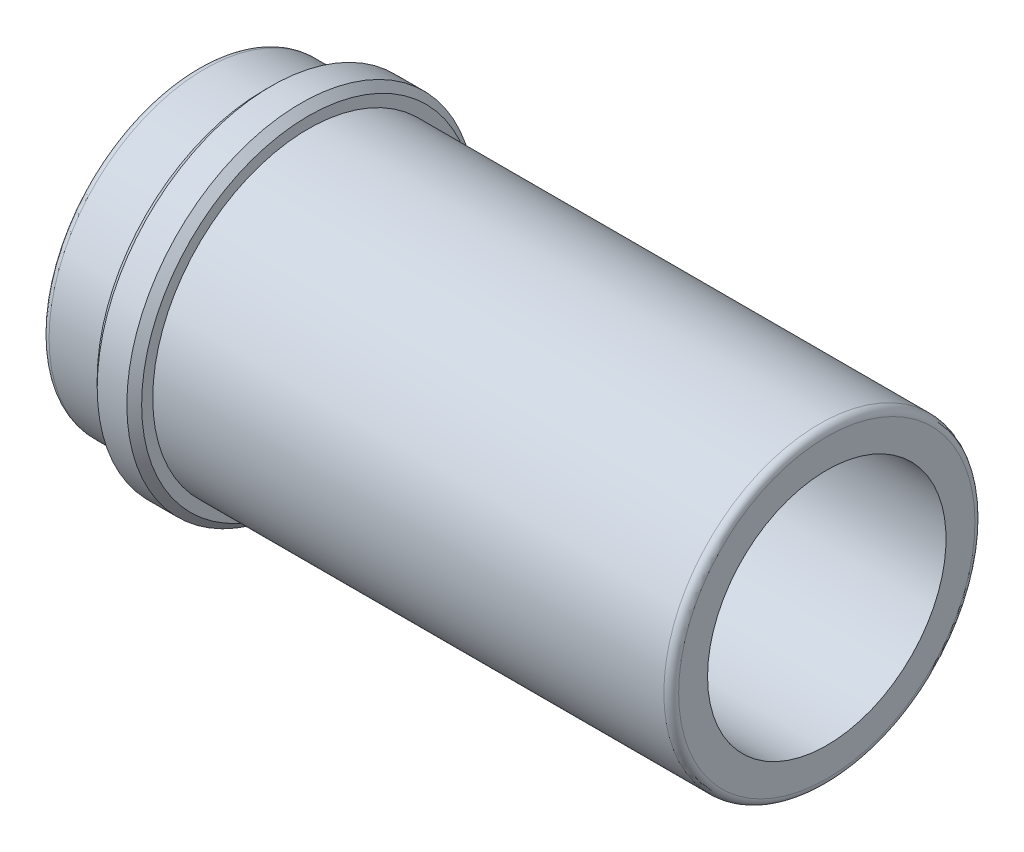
ISO-10303-21;
HEADER;
FILE_DESCRIPTION(('STEP AP214'),'2;1');
FILE_NAME('part.step','',(''),(''),'','','');
FILE_SCHEMA(('AUTOMOTIVE_DESIGN { 1 0 10303 214 1 1 1 1 }'));
ENDSEC;
DATA;
#1=APPLICATION_CONTEXT('core data for automotive mechanical design processes');
#2=APPLICATION_PROTOCOL_DEFINITION('international standard','automotive_design',2000,#1);
#3=PRODUCT_CONTEXT('',#1,'mechanical');
#4=PRODUCT('Part','Part','',(#3));
#5=PRODUCT_RELATED_PRODUCT_CATEGORY('part','',(#4));
#6=PRODUCT_DEFINITION_FORMATION('','',#4);
#7=PRODUCT_DEFINITION_CONTEXT('part definition',#1,'design');
#8=PRODUCT_DEFINITION('design','',#6,#7);
#9=PRODUCT_DEFINITION_SHAPE('','',#8);
#10=(LENGTH_UNIT() NAMED_UNIT(*) SI_UNIT(.MILLI.,.METRE.));
#11=(NAMED_UNIT(*) PLANE_ANGLE_UNIT() SI_UNIT($,.RADIAN.));
#12=(NAMED_UNIT(*) SI_UNIT($,.STERADIAN.) SOLID_ANGLE_UNIT());
#13=UNCERTAINTY_MEASURE_WITH_UNIT(LENGTH_MEASURE(1.E-05),#10,'distance_accuracy_value','');
#14=(GEOMETRIC_REPRESENTATION_CONTEXT(3) GLOBAL_UNCERTAINTY_ASSIGNED_CONTEXT((#13)) GLOBAL_UNIT_ASSIGNED_CONTEXT((#10,
#11,#12)) REPRESENTATION_CONTEXT('',''));
#15=CARTESIAN_POINT('',(0.,0.,0.));
#16=DIRECTION('',(0.,0.,1.));
#17=DIRECTION('',(1.,0.,0.));
#18=AXIS2_PLACEMENT_3D('',#15,#16,#17);
#19=CARTESIAN_POINT('',(9.,21.,0.));
#20=DIRECTION('',(1.,0.,0.));
#21=DIRECTION('',(0.,0.,-1.));
#22=AXIS2_PLACEMENT_3D('',#19,#20,#21);
#23=PLANE('',#22);
#24=CARTESIAN_POINT('',(9.,0.,0.));
#25=DIRECTION('',(1.,0.,0.));
#26=DIRECTION('',(0.,0.,-1.));
#27=AXIS2_PLACEMENT_3D('',#24,#25,#26);
#28=CIRCLE('',#27,22.5);
#29=CARTESIAN_POINT('',(9.,0.,-22.5));
#30=VERTEX_POINT('',#29);
#31=EDGE_CURVE('E9',#30,#30,#28,.F.);
#32=ORIENTED_EDGE('',*,*,#31,.T.);
#33=EDGE_LOOP('',(#32));
#34=FACE_BOUND('',#33,.T.);
#35=CARTESIAN_POINT('',(9.,0.,0.));
#36=DIRECTION('',(-1.,0.,0.));
#37=DIRECTION('',(0.,0.,1.));
#38=AXIS2_PLACEMENT_3D('',#35,#36,#37);
#39=CIRCLE('',#38,21.);
#40=CARTESIAN_POINT('',(9.,0.,21.));
#41=VERTEX_POINT('',#40);
#42=EDGE_CURVE('E55',#41,#41,#39,.T.);
#43=ORIENTED_EDGE('',*,*,#42,.F.);
#44=EDGE_LOOP('',(#43));
#45=FACE_BOUND('',#44,.T.);
#46=ADVANCED_FACE('F14',(#34,#45),#23,.F.);
#47=CARTESIAN_POINT('',(0.,0.,0.));
#48=DIRECTION('',(-1.,0.,0.));
#49=DIRECTION('',(0.,0.,1.));
#50=AXIS2_PLACEMENT_3D('',#47,#48,#49);
#51=CYLINDRICAL_SURFACE('',#50,23.5);
#52=CARTESIAN_POINT('',(14.,0.,0.));
#53=DIRECTION('',(-1.,0.,0.));
#54=DIRECTION('',(0.,0.,1.));
#55=AXIS2_PLACEMENT_3D('',#52,#53,#54);
#56=CIRCLE('',#55,23.5);
#57=CARTESIAN_POINT('',(14.,0.,23.5));
#58=VERTEX_POINT('',#57);
#59=EDGE_CURVE('E25',#58,#58,#56,.T.);
#60=ORIENTED_EDGE('',*,*,#59,.T.);
#61=EDGE_LOOP('',(#60));
#62=FACE_BOUND('',#61,.T.);
#63=CARTESIAN_POINT('',(10.,0.,0.));
#64=DIRECTION('',(1.,0.,0.));
#65=DIRECTION('',(0.,0.,-1.));
#66=AXIS2_PLACEMENT_3D('',#63,#64,#65);
#67=CIRCLE('',#66,23.5);
#68=CARTESIAN_POINT('',(10.,0.,-23.5));
#69=VERTEX_POINT('',#68);
#70=EDGE_CURVE('E29',#69,#69,#67,.T.);
#71=ORIENTED_EDGE('',*,*,#70,.T.);
#72=EDGE_LOOP('',(#71));
#73=FACE_BOUND('',#72,.T.);
#74=ADVANCED_FACE('F62',(#62,#73),#51,.T.);
#75=CARTESIAN_POINT('',(15.,23.5,0.));
#76=DIRECTION('',(-1.,0.,0.));
#77=DIRECTION('',(0.,0.,1.));
#78=AXIS2_PLACEMENT_3D('',#75,#76,#77);
#79=PLANE('',#78);
#80=CARTESIAN_POINT('',(15.,0.,0.));
#81=DIRECTION('',(-1.,0.,0.));
#82=DIRECTION('',(0.,0.,1.));
#83=AXIS2_PLACEMENT_3D('',#80,#81,#82);
#84=CIRCLE('',#83,22.5);
#85=CARTESIAN_POINT('',(15.,0.,22.5));
#86=VERTEX_POINT('',#85);
#87=EDGE_CURVE('E21',#86,#86,#84,.F.);
#88=ORIENTED_EDGE('',*,*,#87,.T.);
#89=EDGE_LOOP('',(#88));
#90=FACE_BOUND('',#89,.T.);
#91=CARTESIAN_POINT('',(15.,0.,0.));
#92=DIRECTION('',(-1.,0.,0.));
#93=DIRECTION('',(0.,0.,1.));
#94=AXIS2_PLACEMENT_3D('',#91,#92,#93);
#95=CIRCLE('',#94,21.);
#96=CARTESIAN_POINT('',(15.,0.,21.));
#97=VERTEX_POINT('',#96);
#98=EDGE_CURVE('E46',#97,#97,#95,.T.);
#99=ORIENTED_EDGE('',*,*,#98,.T.);
#100=EDGE_LOOP('',(#99));
#101=FACE_BOUND('',#100,.T.);
#102=ADVANCED_FACE('F69',(#90,#101),#79,.F.);
#103=CARTESIAN_POINT('',(0.,0.,0.));
#104=DIRECTION('',(-1.,0.,0.));
#105=DIRECTION('',(0.,0.,1.));
#106=AXIS2_PLACEMENT_3D('',#103,#104,#105);
#107=CYLINDRICAL_SURFACE('',#106,21.);
#108=CARTESIAN_POINT('',(84.,0.,0.));
#109=DIRECTION('',(-1.,0.,0.));
#110=DIRECTION('',(0.,0.,1.));
#111=AXIS2_PLACEMENT_3D('',#108,#109,#110);
#112=CIRCLE('',#111,21.);
#113=CARTESIAN_POINT('',(84.,0.,21.));
#114=VERTEX_POINT('',#113);
#115=EDGE_CURVE('E43',#114,#114,#112,.T.);
#116=ORIENTED_EDGE('',*,*,#115,.T.);
#117=EDGE_LOOP('',(#116));
#118=FACE_BOUND('',#117,.T.);
#119=ORIENTED_EDGE('',*,*,#98,.F.);
#120=EDGE_LOOP('',(#119));
#121=FACE_BOUND('',#120,.T.);
#122=ADVANCED_FACE('F114',(#118,#121),#107,.T.);
#123=CARTESIAN_POINT('',(85.,21.,0.));
#124=DIRECTION('',(-1.,0.,0.));
#125=DIRECTION('',(0.,0.,1.));
#126=AXIS2_PLACEMENT_3D('',#123,#124,#125);
#127=PLANE('',#126);
#128=CARTESIAN_POINT('',(85.,0.,0.));
#129=DIRECTION('',(-1.,0.,0.));
#130=DIRECTION('',(0.,0.,1.));
#131=AXIS2_PLACEMENT_3D('',#128,#129,#130);
#132=CIRCLE('',#131,20.);
#133=CARTESIAN_POINT('',(85.,0.,20.));
#134=VERTEX_POINT('',#133);
#135=EDGE_CURVE('E40',#134,#134,#132,.F.);
#136=ORIENTED_EDGE('',*,*,#135,.T.);
#137=EDGE_LOOP('',(#136));
#138=FACE_BOUND('',#137,.T.);
#139=CARTESIAN_POINT('',(85.,0.,0.));
#140=DIRECTION('',(-1.,0.,0.));
#141=DIRECTION('',(0.,0.,1.));
#142=AXIS2_PLACEMENT_3D('',#139,#140,#141);
#143=CIRCLE('',#142,16.1);
#144=CARTESIAN_POINT('',(85.,0.,16.1));
#145=VERTEX_POINT('',#144);
#146=EDGE_CURVE('E49',#145,#145,#143,.T.);
#147=ORIENTED_EDGE('',*,*,#146,.T.);
#148=EDGE_LOOP('',(#147));
#149=FACE_BOUND('',#148,.T.);
#150=ADVANCED_FACE('F144',(#138,#149),#127,.F.);
#151=CARTESIAN_POINT('',(0.,0.,0.));
#152=DIRECTION('',(-1.,0.,0.));
#153=DIRECTION('',(0.,0.,1.));
#154=AXIS2_PLACEMENT_3D('',#151,#152,#153);
#155=CYLINDRICAL_SURFACE('',#154,16.1);
#156=ORIENTED_EDGE('',*,*,#146,.F.);
#157=EDGE_LOOP('',(#156));
#158=FACE_BOUND('',#157,.T.);
#159=CARTESIAN_POINT('',(0.,0.,0.));
#160=DIRECTION('',(-1.,0.,0.));
#161=DIRECTION('',(0.,0.,1.));
#162=AXIS2_PLACEMENT_3D('',#159,#160,#161);
#163=CIRCLE('',#162,16.1);
#164=CARTESIAN_POINT('',(0.,0.,16.1));
#165=VERTEX_POINT('',#164);
#166=EDGE_CURVE('E52',#165,#165,#163,.T.);
#167=ORIENTED_EDGE('',*,*,#166,.T.);
#168=EDGE_LOOP('',(#167));
#169=FACE_BOUND('',#168,.T.);
#170=ADVANCED_FACE('F136',(#158,#169),#155,.F.);
#171=CARTESIAN_POINT('',(0.,16.1,0.));
#172=DIRECTION('',(1.,0.,0.));
#173=DIRECTION('',(0.,0.,-1.));
#174=AXIS2_PLACEMENT_3D('',#171,#172,#173);
#175=PLANE('',#174);
#176=CARTESIAN_POINT('',(0.,0.,0.));
#177=DIRECTION('',(1.,0.,0.));
#178=DIRECTION('',(0.,0.,-1.));
#179=AXIS2_PLACEMENT_3D('',#176,#177,#178);
#180=CIRCLE('',#179,20.);
#181=CARTESIAN_POINT('',(0.,0.,-20.));
#182=VERTEX_POINT('',#181);
#183=EDGE_CURVE('E37',#182,#182,#180,.F.);
#184=ORIENTED_EDGE('',*,*,#183,.T.);
#185=EDGE_LOOP('',(#184));
#186=FACE_BOUND('',#185,.T.);
#187=ORIENTED_EDGE('',*,*,#166,.F.);
#188=EDGE_LOOP('',(#187));
#189=FACE_BOUND('',#188,.T.);
#190=ADVANCED_FACE('F125',(#186,#189),#175,.F.);
#191=CARTESIAN_POINT('',(0.,0.,0.));
#192=DIRECTION('',(-1.,0.,0.));
#193=DIRECTION('',(0.,0.,1.));
#194=AXIS2_PLACEMENT_3D('',#191,#192,#193);
#195=CYLINDRICAL_SURFACE('',#194,21.);
#196=CARTESIAN_POINT('',(1.,0.,0.));
#197=DIRECTION('',(1.,0.,0.));
#198=DIRECTION('',(0.,0.,-1.));
#199=AXIS2_PLACEMENT_3D('',#196,#197,#198);
#200=CIRCLE('',#199,21.);
#201=CARTESIAN_POINT('',(1.,0.,-21.));
#202=VERTEX_POINT('',#201);
#203=EDGE_CURVE('E34',#202,#202,#200,.T.);
#204=ORIENTED_EDGE('',*,*,#203,.T.);
#205=EDGE_LOOP('',(#204));
#206=FACE_BOUND('',#205,.T.);
#207=ORIENTED_EDGE('',*,*,#42,.T.);
#208=EDGE_LOOP('',(#207));
#209=FACE_BOUND('',#208,.T.);
#210=ADVANCED_FACE('F59',(#206,#209),#195,.T.);
#211=CARTESIAN_POINT('',(84.,0.,0.));
#212=DIRECTION('',(-1.,0.,0.));
#213=DIRECTION('',(0.,0.,1.));
#214=AXIS2_PLACEMENT_3D('',#211,#212,#213);
#215=TOROIDAL_SURFACE('',#214,20.,1.);
#216=ORIENTED_EDGE('',*,*,#135,.F.);
#217=EDGE_LOOP('',(#216));
#218=FACE_BOUND('',#217,.T.);
#219=ORIENTED_EDGE('',*,*,#115,.F.);
#220=EDGE_LOOP('',(#219));
#221=FACE_BOUND('',#220,.T.);
#222=ADVANCED_FACE('F74',(#218,#221),#215,.T.);
#223=CARTESIAN_POINT('',(1.,0.,0.));
#224=DIRECTION('',(1.,0.,0.));
#225=DIRECTION('',(0.,0.,-1.));
#226=AXIS2_PLACEMENT_3D('',#223,#224,#225);
#227=TOROIDAL_SURFACE('',#226,20.,1.);
#228=ORIENTED_EDGE('',*,*,#203,.F.);
#229=EDGE_LOOP('',(#228));
#230=FACE_BOUND('',#229,.T.);
#231=ORIENTED_EDGE('',*,*,#183,.F.);
#232=EDGE_LOOP('',(#231));
#233=FACE_BOUND('',#232,.T.);
#234=ADVANCED_FACE('F77',(#230,#233),#227,.T.);
#235=CARTESIAN_POINT('',(14.,0.,0.));
#236=DIRECTION('',(-1.,0.,0.));
#237=DIRECTION('',(0.,0.,1.));
#238=AXIS2_PLACEMENT_3D('',#235,#236,#237);
#239=CONICAL_SURFACE('',#238,23.5,0.785398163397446);
#240=ORIENTED_EDGE('',*,*,#87,.F.);
#241=EDGE_LOOP('',(#240));
#242=FACE_BOUND('',#241,.T.);
#243=ORIENTED_EDGE('',*,*,#59,.F.);
#244=EDGE_LOOP('',(#243));
#245=FACE_BOUND('',#244,.T.);
#246=ADVANCED_FACE('F80',(#242,#245),#239,.T.);
#247=CARTESIAN_POINT('',(9.,0.,0.));
#248=DIRECTION('',(1.,0.,0.));
#249=DIRECTION('',(0.,0.,-1.));
#250=AXIS2_PLACEMENT_3D('',#247,#248,#249);
#251=CONICAL_SURFACE('',#250,22.5,0.785398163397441);
#252=ORIENTED_EDGE('',*,*,#70,.F.);
#253=EDGE_LOOP('',(#252));
#254=FACE_BOUND('',#253,.T.);
#255=ORIENTED_EDGE('',*,*,#31,.F.);
#256=EDGE_LOOP('',(#255));
#257=FACE_BOUND('',#256,.T.);
#258=ADVANCED_FACE('F16',(#254,#257),#251,.T.);
#259=CLOSED_SHELL('',(#46,#74,#102,#122,#150,#170,#190,#210,#222,#234,#246,#258));
#260=MANIFOLD_SOLID_BREP('B1',#259);
#261=ADVANCED_BREP_SHAPE_REPRESENTATION('',(#18,#260),#14);
#262=SHAPE_DEFINITION_REPRESENTATION(#9,#261);
ENDSEC;
END-ISO-10303-21;
